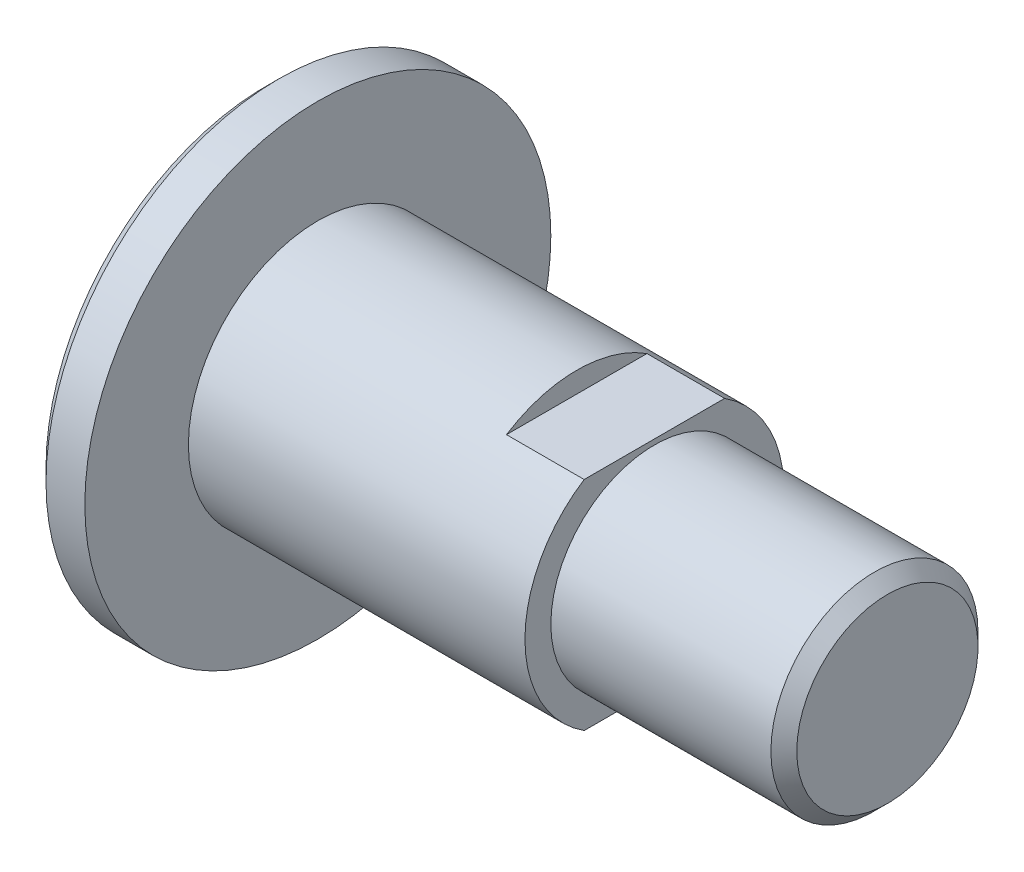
ISO-10303-21;
HEADER;
FILE_DESCRIPTION(('STEP AP214'),'2;1');
FILE_NAME('part.step','',(''),(''),'','','');
FILE_SCHEMA(('AUTOMOTIVE_DESIGN { 1 0 10303 214 1 1 1 1 }'));
ENDSEC;
DATA;
#1=APPLICATION_CONTEXT('core data for automotive mechanical design processes');
#2=APPLICATION_PROTOCOL_DEFINITION('international standard','automotive_design',2000,#1);
#3=PRODUCT_CONTEXT('',#1,'mechanical');
#4=PRODUCT('Part','Part','',(#3));
#5=PRODUCT_RELATED_PRODUCT_CATEGORY('part','',(#4));
#6=PRODUCT_DEFINITION_FORMATION('','',#4);
#7=PRODUCT_DEFINITION_CONTEXT('part definition',#1,'design');
#8=PRODUCT_DEFINITION('design','',#6,#7);
#9=PRODUCT_DEFINITION_SHAPE('','',#8);
#10=(LENGTH_UNIT() NAMED_UNIT(*) SI_UNIT(.MILLI.,.METRE.));
#11=(NAMED_UNIT(*) PLANE_ANGLE_UNIT() SI_UNIT($,.RADIAN.));
#12=(NAMED_UNIT(*) SI_UNIT($,.STERADIAN.) SOLID_ANGLE_UNIT());
#13=UNCERTAINTY_MEASURE_WITH_UNIT(LENGTH_MEASURE(1.E-05),#10,'distance_accuracy_value','');
#14=(GEOMETRIC_REPRESENTATION_CONTEXT(3) GLOBAL_UNCERTAINTY_ASSIGNED_CONTEXT((#13)) GLOBAL_UNIT_ASSIGNED_CONTEXT((#10,
#11,#12)) REPRESENTATION_CONTEXT('',''));
#15=CARTESIAN_POINT('',(0.,0.,0.));
#16=DIRECTION('',(0.,0.,1.));
#17=DIRECTION('',(1.,0.,0.));
#18=AXIS2_PLACEMENT_3D('',#15,#16,#17);
#19=CARTESIAN_POINT('',(-3.,0.,0.));
#20=DIRECTION('',(-1.,0.,0.));
#21=DIRECTION('',(0.,0.,1.));
#22=AXIS2_PLACEMENT_3D('',#19,#20,#21);
#23=CYLINDRICAL_SURFACE('',#22,5.);
#24=DIRECTION('',(-1.,0.,0.));
#25=VECTOR('',#24,1.);
#26=CARTESIAN_POINT('',(-3.,-4.2,-2.7129319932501));
#27=LINE('',#26,#25);
#28=CARTESIAN_POINT('',(12.,-4.2,-2.71293199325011));
#29=VERTEX_POINT('',#28);
#30=CARTESIAN_POINT('',(15.,-4.2,-2.71293199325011));
#31=VERTEX_POINT('',#30);
#32=EDGE_CURVE('E48',#29,#31,#27,.F.);
#33=ORIENTED_EDGE('',*,*,#32,.F.);
#34=CARTESIAN_POINT('',(12.,0.,0.));
#35=DIRECTION('',(1.,0.,0.));
#36=DIRECTION('',(0.,0.,-1.));
#37=AXIS2_PLACEMENT_3D('',#34,#35,#36);
#38=CIRCLE('',#37,5.);
#39=CARTESIAN_POINT('',(12.,-4.2,2.71293199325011));
#40=VERTEX_POINT('',#39);
#41=EDGE_CURVE('E11',#29,#40,#38,.F.);
#42=ORIENTED_EDGE('',*,*,#41,.T.);
#43=DIRECTION('',(-1.,0.,0.));
#44=VECTOR('',#43,1.);
#45=CARTESIAN_POINT('',(-3.,-4.2,2.7129319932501));
#46=LINE('',#45,#44);
#47=CARTESIAN_POINT('',(15.,-4.2,2.71293199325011));
#48=VERTEX_POINT('',#47);
#49=EDGE_CURVE('E79',#48,#40,#46,.T.);
#50=ORIENTED_EDGE('',*,*,#49,.F.);
#51=CARTESIAN_POINT('',(15.,0.,0.));
#52=DIRECTION('',(-1.,0.,0.));
#53=DIRECTION('',(0.,0.,1.));
#54=AXIS2_PLACEMENT_3D('',#51,#52,#53);
#55=CIRCLE('',#54,5.);
#56=CARTESIAN_POINT('',(15.,4.2,2.71293199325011));
#57=VERTEX_POINT('',#56);
#58=EDGE_CURVE('E56',#48,#57,#55,.T.);
#59=ORIENTED_EDGE('',*,*,#58,.T.);
#60=DIRECTION('',(-1.,0.,0.));
#61=VECTOR('',#60,1.);
#62=CARTESIAN_POINT('',(-3.,4.2,2.7129319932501));
#63=LINE('',#62,#61);
#64=CARTESIAN_POINT('',(12.,4.2,2.7129319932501));
#65=VERTEX_POINT('',#64);
#66=EDGE_CURVE('E89',#57,#65,#63,.T.);
#67=ORIENTED_EDGE('',*,*,#66,.T.);
#68=CARTESIAN_POINT('',(12.,0.,0.));
#69=DIRECTION('',(-1.,0.,0.));
#70=DIRECTION('',(0.,0.,1.));
#71=AXIS2_PLACEMENT_3D('',#68,#69,#70);
#72=CIRCLE('',#71,5.);
#73=CARTESIAN_POINT('',(12.,4.2,-2.7129319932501));
#74=VERTEX_POINT('',#73);
#75=EDGE_CURVE('E121',#74,#65,#72,.F.);
#76=ORIENTED_EDGE('',*,*,#75,.F.);
#77=DIRECTION('',(-1.,0.,0.));
#78=VECTOR('',#77,1.);
#79=CARTESIAN_POINT('',(-3.,4.2,-2.7129319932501));
#80=LINE('',#79,#78);
#81=CARTESIAN_POINT('',(15.,4.2,-2.71293199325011));
#82=VERTEX_POINT('',#81);
#83=EDGE_CURVE('E94',#74,#82,#80,.F.);
#84=ORIENTED_EDGE('',*,*,#83,.T.);
#85=EDGE_CURVE('E85',#82,#31,#55,.T.);
#86=ORIENTED_EDGE('',*,*,#85,.T.);
#87=EDGE_LOOP('',(#33,#42,#50,#59,#67,#76,#84,#86));
#88=FACE_BOUND('',#87,.T.);
#89=CARTESIAN_POINT('',(2.,0.,0.));
#90=DIRECTION('',(-1.,0.,0.));
#91=DIRECTION('',(0.,0.,1.));
#92=AXIS2_PLACEMENT_3D('',#89,#90,#91);
#93=CIRCLE('',#92,5.);
#94=CARTESIAN_POINT('',(2.,0.,5.));
#95=VERTEX_POINT('',#94);
#96=EDGE_CURVE('E106',#95,#95,#93,.T.);
#97=ORIENTED_EDGE('',*,*,#96,.F.);
#98=EDGE_LOOP('',(#97));
#99=FACE_BOUND('',#98,.T.);
#100=ADVANCED_FACE('F33',(#88,#99),#23,.T.);
#101=CARTESIAN_POINT('',(15.,5.,0.));
#102=DIRECTION('',(1.,0.,0.));
#103=DIRECTION('',(0.,0.,-1.));
#104=AXIS2_PLACEMENT_3D('',#101,#102,#103);
#105=PLANE('',#104);
#106=DIRECTION('',(0.,0.,1.));
#107=VECTOR('',#106,1.);
#108=CARTESIAN_POINT('',(15.,-4.2,0.));
#109=LINE('',#108,#107);
#110=EDGE_CURVE('E41',#31,#48,#109,.T.);
#111=ORIENTED_EDGE('',*,*,#110,.F.);
#112=ORIENTED_EDGE('',*,*,#85,.F.);
#113=DIRECTION('',(0.,0.,1.));
#114=VECTOR('',#113,1.);
#115=CARTESIAN_POINT('',(15.,4.2,0.));
#116=LINE('',#115,#114);
#117=EDGE_CURVE('E118',#82,#57,#116,.T.);
#118=ORIENTED_EDGE('',*,*,#117,.T.);
#119=ORIENTED_EDGE('',*,*,#58,.F.);
#120=EDGE_LOOP('',(#111,#112,#118,#119));
#121=FACE_BOUND('',#120,.T.);
#122=CARTESIAN_POINT('',(15.,0.,0.));
#123=DIRECTION('',(-1.,0.,0.));
#124=DIRECTION('',(0.,0.,1.));
#125=AXIS2_PLACEMENT_3D('',#122,#123,#124);
#126=CIRCLE('',#125,4.);
#127=CARTESIAN_POINT('',(15.,0.,4.));
#128=VERTEX_POINT('',#127);
#129=EDGE_CURVE('E102',#128,#128,#126,.T.);
#130=ORIENTED_EDGE('',*,*,#129,.T.);
#131=EDGE_LOOP('',(#130));
#132=FACE_BOUND('',#131,.T.);
#133=ADVANCED_FACE('F123',(#121,#132),#105,.T.);
#134=CARTESIAN_POINT('',(0.,0.,0.));
#135=DIRECTION('',(-1.,0.,0.));
#136=DIRECTION('',(0.,0.,1.));
#137=AXIS2_PLACEMENT_3D('',#134,#135,#136);
#138=PLANE('',#137);
#139=CARTESIAN_POINT('',(0.,0.,0.));
#140=DIRECTION('',(-1.,0.,0.));
#141=DIRECTION('',(0.,0.,1.));
#142=AXIS2_PLACEMENT_3D('',#139,#140,#141);
#143=CIRCLE('',#142,8.5);
#144=CARTESIAN_POINT('',(0.,0.,8.5));
#145=VERTEX_POINT('',#144);
#146=EDGE_CURVE('E115',#145,#145,#143,.T.);
#147=ORIENTED_EDGE('',*,*,#146,.T.);
#148=EDGE_LOOP('',(#147));
#149=FACE_BOUND('',#148,.T.);
#150=ADVANCED_FACE('F35',(#149),#138,.T.);
#151=CARTESIAN_POINT('',(0.,0.,0.));
#152=DIRECTION('',(1.,0.,0.));
#153=DIRECTION('',(0.,0.,-1.));
#154=AXIS2_PLACEMENT_3D('',#151,#152,#153);
#155=CONICAL_SURFACE('',#154,8.5,0.785398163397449);
#156=CARTESIAN_POINT('',(0.5,0.,0.));
#157=DIRECTION('',(-1.,0.,0.));
#158=DIRECTION('',(0.,0.,1.));
#159=AXIS2_PLACEMENT_3D('',#156,#157,#158);
#160=CIRCLE('',#159,9.);
#161=CARTESIAN_POINT('',(0.5,0.,9.));
#162=VERTEX_POINT('',#161);
#163=EDGE_CURVE('E112',#162,#162,#160,.T.);
#164=ORIENTED_EDGE('',*,*,#163,.T.);
#165=EDGE_LOOP('',(#164));
#166=FACE_BOUND('',#165,.T.);
#167=ORIENTED_EDGE('',*,*,#146,.F.);
#168=EDGE_LOOP('',(#167));
#169=FACE_BOUND('',#168,.T.);
#170=ADVANCED_FACE('F157',(#166,#169),#155,.T.);
#171=CARTESIAN_POINT('',(-3.,0.,0.));
#172=DIRECTION('',(-1.,0.,0.));
#173=DIRECTION('',(0.,0.,1.));
#174=AXIS2_PLACEMENT_3D('',#171,#172,#173);
#175=CYLINDRICAL_SURFACE('',#174,9.);
#176=CARTESIAN_POINT('',(2.,0.,0.));
#177=DIRECTION('',(-1.,0.,0.));
#178=DIRECTION('',(0.,0.,1.));
#179=AXIS2_PLACEMENT_3D('',#176,#177,#178);
#180=CIRCLE('',#179,9.);
#181=CARTESIAN_POINT('',(2.,0.,9.));
#182=VERTEX_POINT('',#181);
#183=EDGE_CURVE('E109',#182,#182,#180,.T.);
#184=ORIENTED_EDGE('',*,*,#183,.T.);
#185=EDGE_LOOP('',(#184));
#186=FACE_BOUND('',#185,.T.);
#187=ORIENTED_EDGE('',*,*,#163,.F.);
#188=EDGE_LOOP('',(#187));
#189=FACE_BOUND('',#188,.T.);
#190=ADVANCED_FACE('F154',(#186,#189),#175,.T.);
#191=CARTESIAN_POINT('',(2.,9.,0.));
#192=DIRECTION('',(1.,0.,0.));
#193=DIRECTION('',(0.,0.,-1.));
#194=AXIS2_PLACEMENT_3D('',#191,#192,#193);
#195=PLANE('',#194);
#196=ORIENTED_EDGE('',*,*,#96,.T.);
#197=EDGE_LOOP('',(#196));
#198=FACE_BOUND('',#197,.T.);
#199=ORIENTED_EDGE('',*,*,#183,.F.);
#200=EDGE_LOOP('',(#199));
#201=FACE_BOUND('',#200,.T.);
#202=ADVANCED_FACE('F150',(#198,#201),#195,.T.);
#203=CARTESIAN_POINT('',(-3.,0.,0.));
#204=DIRECTION('',(-1.,0.,0.));
#205=DIRECTION('',(0.,0.,1.));
#206=AXIS2_PLACEMENT_3D('',#203,#204,#205);
#207=CYLINDRICAL_SURFACE('',#206,4.);
#208=CARTESIAN_POINT('',(23.5,0.,0.));
#209=DIRECTION('',(-1.,0.,0.));
#210=DIRECTION('',(0.,0.,1.));
#211=AXIS2_PLACEMENT_3D('',#208,#209,#210);
#212=CIRCLE('',#211,4.);
#213=CARTESIAN_POINT('',(23.5,0.,4.));
#214=VERTEX_POINT('',#213);
#215=EDGE_CURVE('E99',#214,#214,#212,.T.);
#216=ORIENTED_EDGE('',*,*,#215,.T.);
#217=EDGE_LOOP('',(#216));
#218=FACE_BOUND('',#217,.T.);
#219=ORIENTED_EDGE('',*,*,#129,.F.);
#220=EDGE_LOOP('',(#219));
#221=FACE_BOUND('',#220,.T.);
#222=ADVANCED_FACE('F153',(#218,#221),#207,.T.);
#223=CARTESIAN_POINT('',(23.5,0.,0.));
#224=DIRECTION('',(-1.,0.,0.));
#225=DIRECTION('',(0.,0.,1.));
#226=AXIS2_PLACEMENT_3D('',#223,#224,#225);
#227=CONICAL_SURFACE('',#226,4.,0.785398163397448);
#228=CARTESIAN_POINT('',(24.,0.,0.));
#229=DIRECTION('',(-1.,0.,0.));
#230=DIRECTION('',(0.,0.,1.));
#231=AXIS2_PLACEMENT_3D('',#228,#229,#230);
#232=CIRCLE('',#231,3.5);
#233=CARTESIAN_POINT('',(24.,0.,3.5));
#234=VERTEX_POINT('',#233);
#235=EDGE_CURVE('E96',#234,#234,#232,.T.);
#236=ORIENTED_EDGE('',*,*,#235,.T.);
#237=EDGE_LOOP('',(#236));
#238=FACE_BOUND('',#237,.T.);
#239=ORIENTED_EDGE('',*,*,#215,.F.);
#240=EDGE_LOOP('',(#239));
#241=FACE_BOUND('',#240,.T.);
#242=ADVANCED_FACE('F139',(#238,#241),#227,.T.);
#243=CARTESIAN_POINT('',(24.,3.5,0.));
#244=DIRECTION('',(1.,0.,0.));
#245=DIRECTION('',(0.,0.,-1.));
#246=AXIS2_PLACEMENT_3D('',#243,#244,#245);
#247=PLANE('',#246);
#248=ORIENTED_EDGE('',*,*,#235,.F.);
#249=EDGE_LOOP('',(#248));
#250=FACE_BOUND('',#249,.T.);
#251=ADVANCED_FACE('F132',(#250),#247,.T.);
#252=CARTESIAN_POINT('',(12.,5.5,-11.));
#253=DIRECTION('',(-1.,0.,0.));
#254=DIRECTION('',(0.,0.,1.));
#255=AXIS2_PLACEMENT_3D('',#252,#253,#254);
#256=PLANE('',#255);
#257=ORIENTED_EDGE('',*,*,#75,.T.);
#258=DIRECTION('',(0.,0.,1.));
#259=VECTOR('',#258,1.);
#260=CARTESIAN_POINT('',(12.,4.2,-11.));
#261=LINE('',#260,#259);
#262=EDGE_CURVE('E86',#74,#65,#261,.T.);
#263=ORIENTED_EDGE('',*,*,#262,.F.);
#264=EDGE_LOOP('',(#257,#263));
#265=FACE_BOUND('',#264,.T.);
#266=ADVANCED_FACE('F130',(#265),#256,.F.);
#267=CARTESIAN_POINT('',(16.,4.2,-11.));
#268=DIRECTION('',(0.,1.,0.));
#269=DIRECTION('',(-1.,0.,0.));
#270=AXIS2_PLACEMENT_3D('',#267,#268,#269);
#271=PLANE('',#270);
#272=ORIENTED_EDGE('',*,*,#262,.T.);
#273=ORIENTED_EDGE('',*,*,#66,.F.);
#274=ORIENTED_EDGE('',*,*,#117,.F.);
#275=ORIENTED_EDGE('',*,*,#83,.F.);
#276=EDGE_LOOP('',(#272,#273,#274,#275));
#277=FACE_BOUND('',#276,.T.);
#278=ADVANCED_FACE('F126',(#277),#271,.T.);
#279=CARTESIAN_POINT('',(16.,-4.2,-11.));
#280=DIRECTION('',(0.,1.,0.));
#281=DIRECTION('',(-1.,0.,0.));
#282=AXIS2_PLACEMENT_3D('',#279,#280,#281);
#283=PLANE('',#282);
#284=ORIENTED_EDGE('',*,*,#32,.T.);
#285=ORIENTED_EDGE('',*,*,#110,.T.);
#286=ORIENTED_EDGE('',*,*,#49,.T.);
#287=DIRECTION('',(0.,0.,1.));
#288=VECTOR('',#287,1.);
#289=CARTESIAN_POINT('',(12.,-4.2,-11.));
#290=LINE('',#289,#288);
#291=EDGE_CURVE('E77',#29,#40,#290,.T.);
#292=ORIENTED_EDGE('',*,*,#291,.F.);
#293=EDGE_LOOP('',(#284,#285,#286,#292));
#294=FACE_BOUND('',#293,.T.);
#295=ADVANCED_FACE('F78',(#294),#283,.F.);
#296=CARTESIAN_POINT('',(12.,-5.5,-11.));
#297=DIRECTION('',(1.,0.,0.));
#298=DIRECTION('',(0.,0.,-1.));
#299=AXIS2_PLACEMENT_3D('',#296,#297,#298);
#300=PLANE('',#299);
#301=ORIENTED_EDGE('',*,*,#291,.T.);
#302=ORIENTED_EDGE('',*,*,#41,.F.);
#303=EDGE_LOOP('',(#301,#302));
#304=FACE_BOUND('',#303,.T.);
#305=ADVANCED_FACE('F76',(#304),#300,.T.);
#306=CLOSED_SHELL('',(#100,#133,#150,#170,#190,#202,#222,#242,#251,#266,#278,#295,#305));
#307=MANIFOLD_SOLID_BREP('B2',#306);
#308=ADVANCED_BREP_SHAPE_REPRESENTATION('',(#18,#307),#14);
#309=SHAPE_DEFINITION_REPRESENTATION(#9,#308);
ENDSEC;
END-ISO-10303-21;
